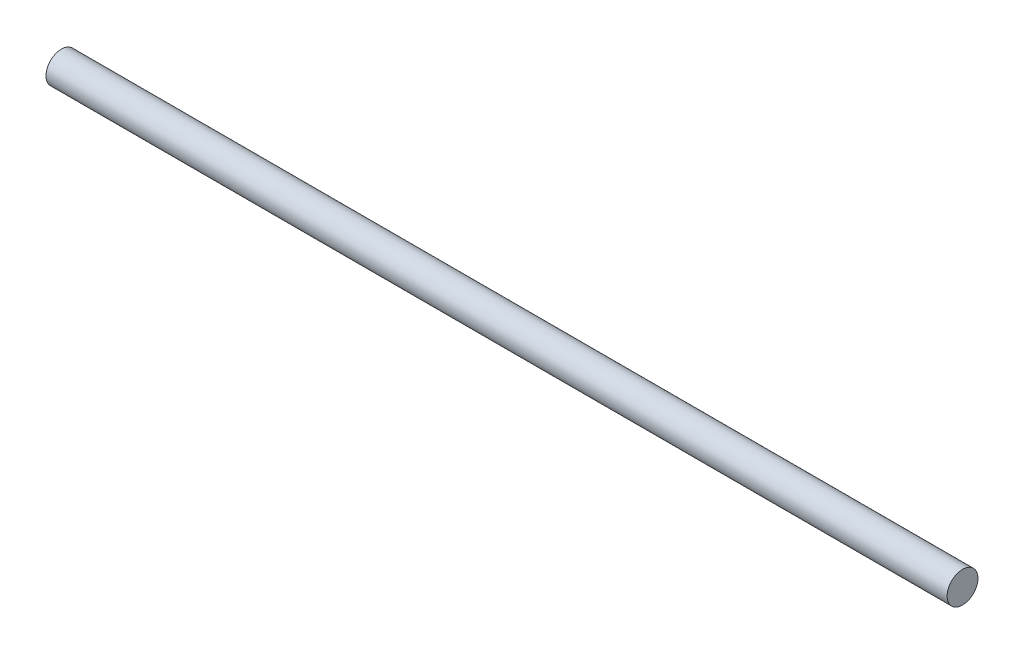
from build123d import *

# Parameters (mm, degrees)
SKETCH1_R           = 3
BOSS_EXTRUDE1_DEPTH = 175


with BuildPart() as part:
    # Sketch1 → Boss-Extrude1 (new body)
    with BuildSketch(Plane(origin=(0, 0, 0), x_dir=(0, 0, -1), z_dir=(1, 0, 0))):
        Circle(SKETCH1_R)
    extrude(amount=BOSS_EXTRUDE1_DEPTH)


solid = part.part
